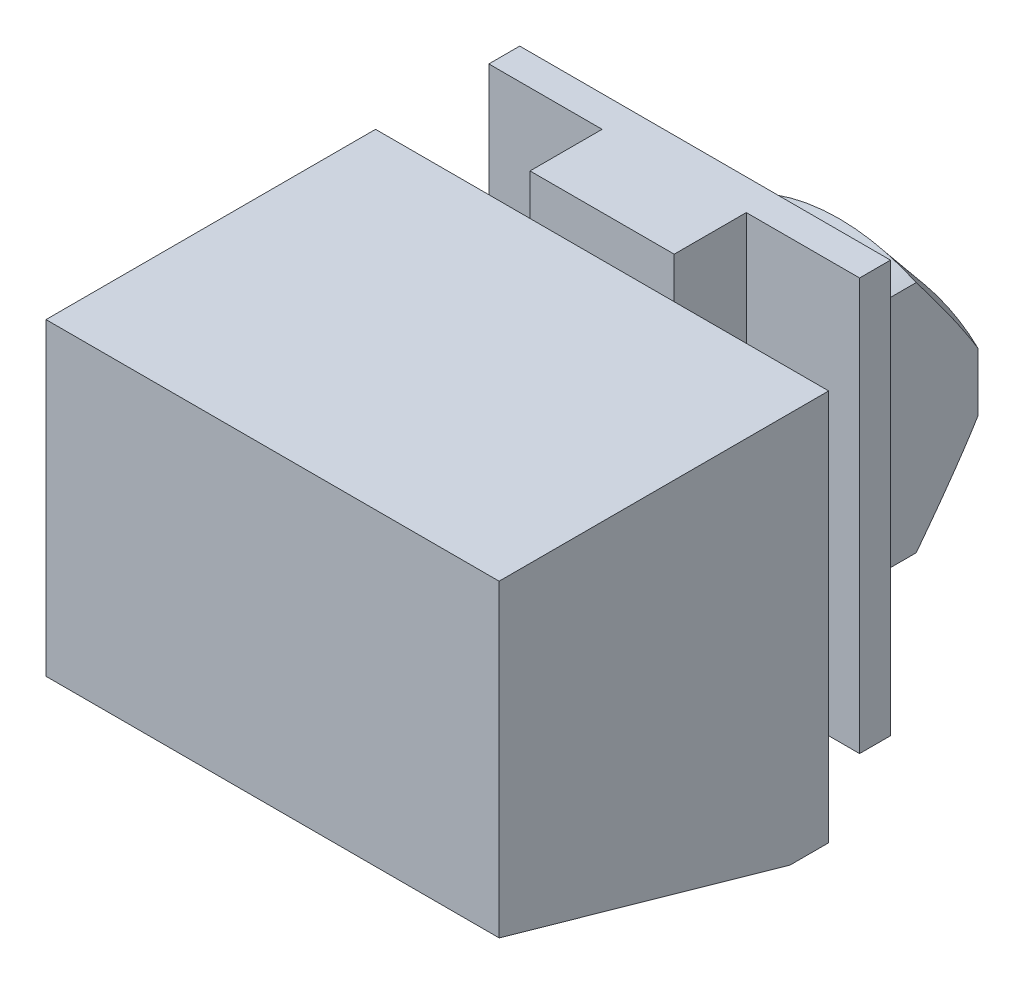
ISO-10303-21;
HEADER;
FILE_DESCRIPTION(('STEP AP214'),'2;1');
FILE_NAME('part.step','',(''),(''),'','','');
FILE_SCHEMA(('AUTOMOTIVE_DESIGN { 1 0 10303 214 1 1 1 1 }'));
ENDSEC;
DATA;
#1=APPLICATION_CONTEXT('core data for automotive mechanical design processes');
#2=APPLICATION_PROTOCOL_DEFINITION('international standard','automotive_design',2000,#1);
#3=PRODUCT_CONTEXT('',#1,'mechanical');
#4=PRODUCT('Part','Part','',(#3));
#5=PRODUCT_RELATED_PRODUCT_CATEGORY('part','',(#4));
#6=PRODUCT_DEFINITION_FORMATION('','',#4);
#7=PRODUCT_DEFINITION_CONTEXT('part definition',#1,'design');
#8=PRODUCT_DEFINITION('design','',#6,#7);
#9=PRODUCT_DEFINITION_SHAPE('','',#8);
#10=(LENGTH_UNIT() NAMED_UNIT(*) SI_UNIT(.MILLI.,.METRE.));
#11=(NAMED_UNIT(*) PLANE_ANGLE_UNIT() SI_UNIT($,.RADIAN.));
#12=(NAMED_UNIT(*) SI_UNIT($,.STERADIAN.) SOLID_ANGLE_UNIT());
#13=UNCERTAINTY_MEASURE_WITH_UNIT(LENGTH_MEASURE(1.E-05),#10,'distance_accuracy_value','');
#14=(GEOMETRIC_REPRESENTATION_CONTEXT(3) GLOBAL_UNCERTAINTY_ASSIGNED_CONTEXT((#13)) GLOBAL_UNIT_ASSIGNED_CONTEXT((#10,
#11,#12)) REPRESENTATION_CONTEXT('',''));
#15=CARTESIAN_POINT('',(0.,0.,0.));
#16=DIRECTION('',(0.,0.,1.));
#17=DIRECTION('',(1.,0.,0.));
#18=AXIS2_PLACEMENT_3D('',#15,#16,#17);
#19=CARTESIAN_POINT('',(-3.75000000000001,-2.98323400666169,-9.5));
#20=DIRECTION('',(0.,0.,-1.));
#21=DIRECTION('',(0.,1.,0.));
#22=AXIS2_PLACEMENT_3D('',#19,#20,#21);
#23=PLANE('',#22);
#24=DIRECTION('',(0.,1.,0.));
#25=VECTOR('',#24,1.);
#26=CARTESIAN_POINT('',(3.75,0.,-9.50000000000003));
#27=LINE('',#26,#25);
#28=CARTESIAN_POINT('',(3.75,1.41985913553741,-9.50000000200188));
#29=VERTEX_POINT('',#28);
#30=CARTESIAN_POINT('',(3.75,-1.41985913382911,-9.50000000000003));
#31=VERTEX_POINT('',#30);
#32=EDGE_CURVE('E191',#29,#31,#27,.F.);
#33=ORIENTED_EDGE('',*,*,#32,.T.);
#34=CARTESIAN_POINT('',(0.,2.5,-9.50000000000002));
#35=DIRECTION('',(0.,0.,1.));
#36=DIRECTION('',(0.,-1.,0.));
#37=AXIS2_PLACEMENT_3D('',#34,#35,#36);
#38=CIRCLE('',#37,5.42473922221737);
#39=CARTESIAN_POINT('',(-3.75,-1.41985913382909,-9.50000000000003));
#40=VERTEX_POINT('',#39);
#41=EDGE_CURVE('E19',#40,#31,#38,.T.);
#42=ORIENTED_EDGE('',*,*,#41,.F.);
#43=DIRECTION('',(0.,1.,0.));
#44=VECTOR('',#43,1.);
#45=CARTESIAN_POINT('',(-3.75,0.,-9.50000000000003));
#46=LINE('',#45,#44);
#47=CARTESIAN_POINT('',(-3.75,1.41985913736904,-9.50000000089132));
#48=VERTEX_POINT('',#47);
#49=EDGE_CURVE('E188',#40,#48,#46,.T.);
#50=ORIENTED_EDGE('',*,*,#49,.T.);
#51=CARTESIAN_POINT('',(0.,-2.5,-9.50000000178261));
#52=DIRECTION('',(0.,0.,1.));
#53=DIRECTION('',(1.,0.,0.));
#54=AXIS2_PLACEMENT_3D('',#51,#52,#53);
#55=CIRCLE('',#54,5.42473922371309);
#56=EDGE_CURVE('E195',#29,#48,#55,.T.);
#57=ORIENTED_EDGE('',*,*,#56,.F.);
#58=EDGE_LOOP('',(#33,#42,#50,#57));
#59=FACE_BOUND('',#58,.T.);
#60=ADVANCED_FACE('F15',(#59),#23,.T.);
#61=CARTESIAN_POINT('',(0.,2.5,-6.5));
#62=DIRECTION('',(0.,0.,1.));
#63=DIRECTION('',(0.,-1.,0.));
#64=AXIS2_PLACEMENT_3D('',#61,#62,#63);
#65=CONICAL_SURFACE('',#64,9.00000000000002,0.872664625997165);
#66=CARTESIAN_POINT('',(3.75,-1.41985913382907,-9.50000000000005));
#67=CARTESIAN_POINT('',(3.75,-1.51281005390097,-9.44363609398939));
#68=CARTESIAN_POINT('',(3.75,-1.60533852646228,-9.38658194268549));
#69=CARTESIAN_POINT('',(3.75,-1.78963228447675,-9.27126241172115));
#70=CARTESIAN_POINT('',(3.75,-1.88139760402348,-9.21299708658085));
#71=CARTESIAN_POINT('',(3.75,-2.15564833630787,-9.03665335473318));
#72=CARTESIAN_POINT('',(3.75,-2.33712455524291,-8.91700517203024));
#73=CARTESIAN_POINT('',(3.75,-2.69780458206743,-8.67458087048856));
#74=CARTESIAN_POINT('',(3.75,-2.87700971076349,-8.55180670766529));
#75=CARTESIAN_POINT('',(3.75,-3.23368469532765,-8.30374639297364));
#76=CARTESIAN_POINT('',(3.75,-3.41115445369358,-8.1784601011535));
#77=CARTESIAN_POINT('',(3.75,-3.76458421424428,-7.92595586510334));
#78=CARTESIAN_POINT('',(3.75,-3.94054489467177,-7.79873886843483));
#79=CARTESIAN_POINT('',(3.75,-4.29129243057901,-7.54269613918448));
#80=CARTESIAN_POINT('',(3.75,-4.46607927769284,-7.41387039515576));
#81=CARTESIAN_POINT('',(3.75,-4.81478223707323,-7.15482700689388));
#82=CARTESIAN_POINT('',(3.75,-4.9886977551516,-7.02460856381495));
#83=CARTESIAN_POINT('',(3.75,-5.33569980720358,-6.76307385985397));
#84=CARTESIAN_POINT('',(3.75,-5.50878634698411,-6.63175760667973));
#85=CARTESIAN_POINT('',(3.75,-5.6815340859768,-6.50000000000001));
#86=B_SPLINE_CURVE_WITH_KNOTS('',3,(#66,#67,#68,#69,#70,#71,#72,#73,#74,#75,#76,#77,#78,#79,#80,
#81,#82,#83,#84,#85),.UNSPECIFIED.,.F.,.F.,(4,2,2,2,2,2,2,2,2,4),(0.,0.326106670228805,
0.652198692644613,1.30425608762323,1.95591503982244,2.60761039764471,3.25899564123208,
3.91038552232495,4.56217155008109,5.21395300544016),.UNSPECIFIED.);
#87=CARTESIAN_POINT('',(3.75,-5.68153408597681,-6.50000000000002));
#88=VERTEX_POINT('',#87);
#89=EDGE_CURVE('E246',#31,#88,#86,.T.);
#90=ORIENTED_EDGE('',*,*,#89,.T.);
#91=CARTESIAN_POINT('',(0.,2.5,-6.50000000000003));
#92=DIRECTION('',(0.,0.,1.));
#93=DIRECTION('',(1.,0.,0.));
#94=AXIS2_PLACEMENT_3D('',#91,#92,#93);
#95=CIRCLE('',#94,9.00000000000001);
#96=CARTESIAN_POINT('',(-3.75,-5.68153408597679,-6.50000000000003));
#97=VERTEX_POINT('',#96);
#98=EDGE_CURVE('E199',#97,#88,#95,.T.);
#99=ORIENTED_EDGE('',*,*,#98,.F.);
#100=CARTESIAN_POINT('',(-3.75,-5.68153408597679,-6.50000000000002));
#101=CARTESIAN_POINT('',(-3.75,-5.50878634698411,-6.63175760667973));
#102=CARTESIAN_POINT('',(-3.75,-5.33569980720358,-6.76307385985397));
#103=CARTESIAN_POINT('',(-3.75,-4.98869775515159,-7.02460856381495));
#104=CARTESIAN_POINT('',(-3.75,-4.81478223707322,-7.15482700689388));
#105=CARTESIAN_POINT('',(-3.75,-4.46607927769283,-7.41387039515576));
#106=CARTESIAN_POINT('',(-3.75,-4.291292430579,-7.54269613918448));
#107=CARTESIAN_POINT('',(-3.75,-3.94054489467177,-7.79873886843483));
#108=CARTESIAN_POINT('',(-3.75,-3.76458421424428,-7.92595586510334));
#109=CARTESIAN_POINT('',(-3.75,-3.41115445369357,-8.1784601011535));
#110=CARTESIAN_POINT('',(-3.75,-3.23368469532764,-8.30374639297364));
#111=CARTESIAN_POINT('',(-3.75,-2.87700971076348,-8.55180670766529));
#112=CARTESIAN_POINT('',(-3.75,-2.69780458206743,-8.67458087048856));
#113=CARTESIAN_POINT('',(-3.75,-2.3371245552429,-8.91700517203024));
#114=CARTESIAN_POINT('',(-3.75,-2.15564833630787,-9.03665335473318));
#115=CARTESIAN_POINT('',(-3.75,-1.88139760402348,-9.21299708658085));
#116=CARTESIAN_POINT('',(-3.75,-1.78963228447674,-9.27126241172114));
#117=CARTESIAN_POINT('',(-3.75,-1.60533852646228,-9.38658194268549));
#118=CARTESIAN_POINT('',(-3.75,-1.51281005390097,-9.44363609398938));
#119=CARTESIAN_POINT('',(-3.75,-1.41985913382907,-9.50000000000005));
#120=B_SPLINE_CURVE_WITH_KNOTS('',3,(#100,#101,#102,#103,#104,#105,#106,#107,#108,#109,#110,
#111,#112,#113,#114,#115,#116,#117,#118,#119),.UNSPECIFIED.,.F.,.F.,(4,2,2,2,2,2,2,2,2,4),(0.,
0.651781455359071,1.3035674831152,1.95495736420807,2.60634260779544,3.25803796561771,
3.90969691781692,4.56175431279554,4.88784633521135,5.21395300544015),.UNSPECIFIED.);
#121=EDGE_CURVE('E197',#97,#40,#120,.T.);
#122=ORIENTED_EDGE('',*,*,#121,.T.);
#123=ORIENTED_EDGE('',*,*,#41,.T.);
#124=EDGE_LOOP('',(#90,#99,#122,#123));
#125=FACE_BOUND('',#124,.T.);
#126=ADVANCED_FACE('F198',(#125),#65,.T.);
#127=CARTESIAN_POINT('',(0.,-2.5,-6.49999999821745));
#128=DIRECTION('',(0.,0.,1.));
#129=DIRECTION('',(1.,0.,0.));
#130=AXIS2_PLACEMENT_3D('',#127,#128,#129);
#131=CONICAL_SURFACE('',#130,8.99999999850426,0.872664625);
#132=CARTESIAN_POINT('',(3.75000000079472,5.68153408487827,-6.49999999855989));
#133=CARTESIAN_POINT('',(3.75000000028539,5.50878634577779,-6.63175760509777));
#134=CARTESIAN_POINT('',(3.75000000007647,5.3356998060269,-6.76307385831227));
#135=CARTESIAN_POINT('',(3.74999999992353,4.9886977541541,-7.02460856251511));
#136=CARTESIAN_POINT('',(3.74999999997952,4.81478223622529,-7.15482700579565));
#137=CARTESIAN_POINT('',(3.75000000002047,4.46607927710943,-7.41387039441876));
#138=CARTESIAN_POINT('',(3.75000000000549,4.29129243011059,-7.54269613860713));
#139=CARTESIAN_POINT('',(3.74999999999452,3.94054489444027,-7.79873886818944));
#140=CARTESIAN_POINT('',(3.74999999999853,3.76458421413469,-7.92595586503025));
#141=CARTESIAN_POINT('',(3.75000000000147,3.41115445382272,-8.17846010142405));
#142=CARTESIAN_POINT('',(3.7500000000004,3.2336846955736,-8.30374639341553));
#143=CARTESIAN_POINT('',(3.74999999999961,2.87700971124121,-8.55180670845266));
#144=CARTESIAN_POINT('',(3.7499999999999,2.69780458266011,-8.67458087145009));
#145=CARTESIAN_POINT('',(3.75000000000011,2.33712455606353,-8.91700517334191));
#146=CARTESIAN_POINT('',(3.75000000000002,2.15564833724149,-9.03665335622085));
#147=CARTESIAN_POINT('',(3.74999999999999,1.88139760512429,-9.21299708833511));
#148=CARTESIAN_POINT('',(3.75,1.78963228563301,-9.27126241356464));
#149=CARTESIAN_POINT('',(3.75000000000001,1.60533852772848,-9.38658194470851));
#150=CARTESIAN_POINT('',(3.75000000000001,1.51281005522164,-9.4436360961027));
#151=CARTESIAN_POINT('',(3.75,1.41985913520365,-9.50000000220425));
#152=B_SPLINE_CURVE_WITH_KNOTS('',3,(#132,#133,#134,#135,#136,#137,#138,#139,#140,#141,#142,
#143,#144,#145,#146,#147,#148,#149,#150,#151),.UNSPECIFIED.,.F.,.F.,(4,2,2,2,2,2,2,2,2,4),(0.,
0.651781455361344,1.3035674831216,1.95495736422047,2.60634260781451,3.25803796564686,
3.90969691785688,4.56175431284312,4.88784633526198,5.21395300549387),.UNSPECIFIED.);
#153=CARTESIAN_POINT('',(3.75,5.68153408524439,-6.49999999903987));
#154=VERTEX_POINT('',#153);
#155=EDGE_CURVE('E254',#154,#29,#152,.T.);
#156=ORIENTED_EDGE('',*,*,#155,.T.);
#157=ORIENTED_EDGE('',*,*,#56,.T.);
#158=CARTESIAN_POINT('',(-3.7499999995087,1.41985913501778,-9.50000000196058));
#159=CARTESIAN_POINT('',(-3.74999999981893,1.51281005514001,-9.44363609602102));
#160=CARTESIAN_POINT('',(-3.74999999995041,1.60533852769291,-9.38658194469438));
#161=CARTESIAN_POINT('',(-3.75000000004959,1.78963228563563,-9.27126241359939));
#162=CARTESIAN_POINT('',(-3.7500000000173,1.88139760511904,-9.2129970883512));
#163=CARTESIAN_POINT('',(-3.7499999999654,2.15564833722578,-9.03665335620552));
#164=CARTESIAN_POINT('',(-3.74999999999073,2.33712455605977,-8.91700517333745));
#165=CARTESIAN_POINT('',(-3.75000000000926,2.69780458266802,-8.67458087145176));
#166=CARTESIAN_POINT('',(-3.75000000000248,2.87700971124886,-8.55180670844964));
#167=CARTESIAN_POINT('',(-3.74999999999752,3.23368469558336,-8.30374639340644));
#168=CARTESIAN_POINT('',(-3.74999999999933,3.41115445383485,-8.1784601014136));
#169=CARTESIAN_POINT('',(-3.75000000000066,3.76458421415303,-7.92595586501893));
#170=CARTESIAN_POINT('',(-3.75000000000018,3.94054489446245,-7.79873886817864));
#171=CARTESIAN_POINT('',(-3.74999999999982,4.29129243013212,-7.54269613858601));
#172=CARTESIAN_POINT('',(-3.74999999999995,4.46607927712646,-7.41387039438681));
#173=CARTESIAN_POINT('',(-3.75000000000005,4.81478223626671,-7.1548270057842));
#174=CARTESIAN_POINT('',(-3.75000000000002,4.98869775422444,-7.02460856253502));
#175=CARTESIAN_POINT('',(-3.74999999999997,5.33569980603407,-6.76307385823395));
#176=CARTESIAN_POINT('',(-3.74999999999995,5.50878634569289,-6.63175760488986));
#177=CARTESIAN_POINT('',(-3.75,5.68153408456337,-6.49999999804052));
#178=B_SPLINE_CURVE_WITH_KNOTS('',3,(#158,#159,#160,#161,#162,#163,#164,#165,#166,#167,#168,
#169,#170,#171,#172,#173,#174,#175,#176,#177),.UNSPECIFIED.,.F.,.F.,(4,2,2,2,2,2,2,2,2,4),(0.,
0.326106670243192,0.652198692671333,1.30425608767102,1.95591503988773,2.60761039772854,
3.25899564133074,3.91038552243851,4.56217155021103,5.21395300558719),.UNSPECIFIED.);
#179=CARTESIAN_POINT('',(-3.74999999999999,5.68153408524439,-6.49999999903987));
#180=VERTEX_POINT('',#179);
#181=EDGE_CURVE('E206',#48,#180,#178,.T.);
#182=ORIENTED_EDGE('',*,*,#181,.T.);
#183=CARTESIAN_POINT('',(0.,-2.5,-6.50000000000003));
#184=DIRECTION('',(0.,0.,-1.));
#185=DIRECTION('',(-1.,0.,0.));
#186=AXIS2_PLACEMENT_3D('',#183,#184,#185);
#187=CIRCLE('',#186,9.);
#188=EDGE_CURVE('E213',#154,#180,#187,.F.);
#189=ORIENTED_EDGE('',*,*,#188,.F.);
#190=EDGE_LOOP('',(#156,#157,#182,#189));
#191=FACE_BOUND('',#190,.T.);
#192=ADVANCED_FACE('F267',(#191),#131,.T.);
#193=CARTESIAN_POINT('',(-3.75,0.,-7.00000000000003));
#194=DIRECTION('',(1.,0.,0.));
#195=DIRECTION('',(0.,0.,-1.));
#196=AXIS2_PLACEMENT_3D('',#193,#194,#195);
#197=PLANE('',#196);
#198=ORIENTED_EDGE('',*,*,#49,.F.);
#199=ORIENTED_EDGE('',*,*,#121,.F.);
#200=DIRECTION('',(0.,0.,-1.));
#201=VECTOR('',#200,1.);
#202=CARTESIAN_POINT('',(-3.74999999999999,-5.68153408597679,-5.50000000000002));
#203=LINE('',#202,#201);
#204=CARTESIAN_POINT('',(-3.75,-5.68153408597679,-4.5));
#205=VERTEX_POINT('',#204);
#206=EDGE_CURVE('E208',#205,#97,#203,.T.);
#207=ORIENTED_EDGE('',*,*,#206,.F.);
#208=DIRECTION('',(0.,-1.,0.));
#209=VECTOR('',#208,1.);
#210=CARTESIAN_POINT('',(-3.75,0.,-4.5));
#211=LINE('',#210,#209);
#212=CARTESIAN_POINT('',(-3.75,5.68153408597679,-4.50000000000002));
#213=VERTEX_POINT('',#212);
#214=EDGE_CURVE('E216',#213,#205,#211,.T.);
#215=ORIENTED_EDGE('',*,*,#214,.F.);
#216=DIRECTION('',(0.,0.,-1.));
#217=VECTOR('',#216,1.);
#218=CARTESIAN_POINT('',(-3.74999999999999,5.68153408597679,-5.5));
#219=LINE('',#218,#217);
#220=EDGE_CURVE('E253',#180,#213,#219,.F.);
#221=ORIENTED_EDGE('',*,*,#220,.F.);
#222=ORIENTED_EDGE('',*,*,#181,.F.);
#223=EDGE_LOOP('',(#198,#199,#207,#215,#221,#222));
#224=FACE_BOUND('',#223,.T.);
#225=ADVANCED_FACE('F204',(#224),#197,.F.);
#226=CARTESIAN_POINT('',(0.,2.5,-4.5));
#227=DIRECTION('',(0.,0.,-1.));
#228=DIRECTION('',(0.,1.,0.));
#229=AXIS2_PLACEMENT_3D('',#226,#227,#228);
#230=CYLINDRICAL_SURFACE('',#229,9.00000000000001);
#231=DIRECTION('',(0.,0.,1.));
#232=VECTOR('',#231,1.);
#233=CARTESIAN_POINT('',(3.75,-5.68153408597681,-7.00000000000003));
#234=LINE('',#233,#232);
#235=CARTESIAN_POINT('',(3.75,-5.6815340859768,-4.5));
#236=VERTEX_POINT('',#235);
#237=EDGE_CURVE('E219',#88,#236,#234,.T.);
#238=ORIENTED_EDGE('',*,*,#237,.T.);
#239=CARTESIAN_POINT('',(0.,2.5,-4.5));
#240=DIRECTION('',(0.,0.,-1.));
#241=DIRECTION('',(0.,1.,0.));
#242=AXIS2_PLACEMENT_3D('',#239,#240,#241);
#243=CIRCLE('',#242,9.00000000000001);
#244=EDGE_CURVE('E243',#205,#236,#243,.F.);
#245=ORIENTED_EDGE('',*,*,#244,.F.);
#246=ORIENTED_EDGE('',*,*,#206,.T.);
#247=ORIENTED_EDGE('',*,*,#98,.T.);
#248=EDGE_LOOP('',(#238,#245,#246,#247));
#249=FACE_BOUND('',#248,.T.);
#250=ADVANCED_FACE('F268',(#249),#230,.T.);
#251=CARTESIAN_POINT('',(3.75,0.,-7.00000000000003));
#252=DIRECTION('',(-1.,0.,0.));
#253=DIRECTION('',(0.,0.,1.));
#254=AXIS2_PLACEMENT_3D('',#251,#252,#253);
#255=PLANE('',#254);
#256=ORIENTED_EDGE('',*,*,#32,.F.);
#257=ORIENTED_EDGE('',*,*,#155,.F.);
#258=DIRECTION('',(0.,0.,-1.));
#259=VECTOR('',#258,1.);
#260=CARTESIAN_POINT('',(3.75,5.68153408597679,-5.5));
#261=LINE('',#260,#259);
#262=CARTESIAN_POINT('',(3.75,5.68153408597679,-4.50000000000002));
#263=VERTEX_POINT('',#262);
#264=EDGE_CURVE('E217',#263,#154,#261,.T.);
#265=ORIENTED_EDGE('',*,*,#264,.F.);
#266=DIRECTION('',(0.,1.,0.));
#267=VECTOR('',#266,1.);
#268=CARTESIAN_POINT('',(3.75,0.,-4.5));
#269=LINE('',#268,#267);
#270=EDGE_CURVE('E242',#236,#263,#269,.T.);
#271=ORIENTED_EDGE('',*,*,#270,.F.);
#272=ORIENTED_EDGE('',*,*,#237,.F.);
#273=ORIENTED_EDGE('',*,*,#89,.F.);
#274=EDGE_LOOP('',(#256,#257,#265,#271,#272,#273));
#275=FACE_BOUND('',#274,.T.);
#276=ADVANCED_FACE('F259',(#275),#255,.F.);
#277=CARTESIAN_POINT('',(0.,-2.5,-5.5));
#278=DIRECTION('',(0.,0.,-1.));
#279=DIRECTION('',(-1.,0.,0.));
#280=AXIS2_PLACEMENT_3D('',#277,#278,#279);
#281=CYLINDRICAL_SURFACE('',#280,9.);
#282=ORIENTED_EDGE('',*,*,#264,.T.);
#283=ORIENTED_EDGE('',*,*,#188,.T.);
#284=ORIENTED_EDGE('',*,*,#220,.T.);
#285=CARTESIAN_POINT('',(0.,-2.5,-4.50000000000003));
#286=DIRECTION('',(0.,0.,-1.));
#287=DIRECTION('',(-1.,0.,0.));
#288=AXIS2_PLACEMENT_3D('',#285,#286,#287);
#289=CIRCLE('',#288,9.);
#290=EDGE_CURVE('E238',#263,#213,#289,.F.);
#291=ORIENTED_EDGE('',*,*,#290,.F.);
#292=EDGE_LOOP('',(#282,#283,#284,#291));
#293=FACE_BOUND('',#292,.T.);
#294=ADVANCED_FACE('F377',(#293),#281,.T.);
#295=CARTESIAN_POINT('',(-3.75,6.63,-4.5));
#296=DIRECTION('',(0.,0.,1.));
#297=DIRECTION('',(0.,-1.,0.));
#298=AXIS2_PLACEMENT_3D('',#295,#296,#297);
#299=PLANE('',#298);
#300=DIRECTION('',(1.,0.,0.));
#301=VECTOR('',#300,1.);
#302=CARTESIAN_POINT('',(3.25,-4.,-4.5));
#303=LINE('',#302,#301);
#304=CARTESIAN_POINT('',(-0.249999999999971,-4.,-4.5));
#305=VERTEX_POINT('',#304);
#306=CARTESIAN_POINT('',(3.25000000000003,-4.,-4.5));
#307=VERTEX_POINT('',#306);
#308=EDGE_CURVE('E408',#305,#307,#303,.T.);
#309=ORIENTED_EDGE('',*,*,#308,.F.);
#310=CARTESIAN_POINT('',(-0.249999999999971,-1.,-4.5));
#311=DIRECTION('',(0.,0.,1.));
#312=DIRECTION('',(1.,0.,0.));
#313=AXIS2_PLACEMENT_3D('',#310,#311,#312);
#314=CIRCLE('',#313,3.);
#315=CARTESIAN_POINT('',(-3.24999999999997,-1.,-4.5));
#316=VERTEX_POINT('',#315);
#317=EDGE_CURVE('E234',#316,#305,#314,.T.);
#318=ORIENTED_EDGE('',*,*,#317,.F.);
#319=DIRECTION('',(0.,1.,0.));
#320=VECTOR('',#319,1.);
#321=CARTESIAN_POINT('',(-3.24999999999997,-1.,-4.5));
#322=LINE('',#321,#320);
#323=CARTESIAN_POINT('',(-3.24999999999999,4.,-4.5));
#324=VERTEX_POINT('',#323);
#325=EDGE_CURVE('E420',#324,#316,#322,.F.);
#326=ORIENTED_EDGE('',*,*,#325,.F.);
#327=DIRECTION('',(1.,0.,0.));
#328=VECTOR('',#327,1.);
#329=CARTESIAN_POINT('',(-3.25,4.,-4.5));
#330=LINE('',#329,#328);
#331=CARTESIAN_POINT('',(0.250000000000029,4.,-4.5));
#332=VERTEX_POINT('',#331);
#333=EDGE_CURVE('E424',#332,#324,#330,.F.);
#334=ORIENTED_EDGE('',*,*,#333,.F.);
#335=CARTESIAN_POINT('',(0.25000000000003,0.999999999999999,-4.5));
#336=DIRECTION('',(0.,0.,1.));
#337=DIRECTION('',(1.,0.,0.));
#338=AXIS2_PLACEMENT_3D('',#335,#336,#337);
#339=CIRCLE('',#338,3.);
#340=CARTESIAN_POINT('',(3.25000000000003,0.999999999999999,-4.5));
#341=VERTEX_POINT('',#340);
#342=EDGE_CURVE('E230',#341,#332,#339,.T.);
#343=ORIENTED_EDGE('',*,*,#342,.F.);
#344=DIRECTION('',(0.,1.,0.));
#345=VECTOR('',#344,1.);
#346=CARTESIAN_POINT('',(3.25000000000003,0.999999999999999,-4.5));
#347=LINE('',#346,#345);
#348=EDGE_CURVE('E406',#307,#341,#347,.T.);
#349=ORIENTED_EDGE('',*,*,#348,.F.);
#350=EDGE_LOOP('',(#309,#318,#326,#334,#343,#349));
#351=FACE_BOUND('',#350,.T.);
#352=ORIENTED_EDGE('',*,*,#270,.T.);
#353=ORIENTED_EDGE('',*,*,#290,.T.);
#354=ORIENTED_EDGE('',*,*,#214,.T.);
#355=ORIENTED_EDGE('',*,*,#244,.T.);
#356=EDGE_LOOP('',(#352,#353,#354,#355));
#357=FACE_BOUND('',#356,.T.);
#358=ADVANCED_FACE('F379',(#351,#357),#299,.T.);
#359=CARTESIAN_POINT('',(-9.00000000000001,12.5,1.5));
#360=DIRECTION('',(-1.,0.,0.));
#361=DIRECTION('',(0.,0.,-1.));
#362=AXIS2_PLACEMENT_3D('',#359,#360,#361);
#363=PLANE('',#362);
#364=DIRECTION('',(0.,1.,0.));
#365=VECTOR('',#364,1.);
#366=CARTESIAN_POINT('',(-9.00000000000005,-7.5,0.));
#367=LINE('',#366,#365);
#368=CARTESIAN_POINT('',(-9.00000000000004,-7.5,0.));
#369=VERTEX_POINT('',#368);
#370=CARTESIAN_POINT('',(-9.00000000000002,12.5,0.));
#371=VERTEX_POINT('',#370);
#372=EDGE_CURVE('E458',#369,#371,#367,.T.);
#373=ORIENTED_EDGE('',*,*,#372,.F.);
#374=DIRECTION('',(0.,0.,1.));
#375=VECTOR('',#374,1.);
#376=CARTESIAN_POINT('',(-9.00000000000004,-7.5,0.749999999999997));
#377=LINE('',#376,#375);
#378=CARTESIAN_POINT('',(-9.00000000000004,-7.5,1.5));
#379=VERTEX_POINT('',#378);
#380=EDGE_CURVE('E421',#369,#379,#377,.T.);
#381=ORIENTED_EDGE('',*,*,#380,.T.);
#382=DIRECTION('',(0.,1.,0.));
#383=VECTOR('',#382,1.);
#384=CARTESIAN_POINT('',(-9.00000000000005,-1.20710678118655,1.5));
#385=LINE('',#384,#383);
#386=CARTESIAN_POINT('',(-9.00000000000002,12.5,1.5));
#387=VERTEX_POINT('',#386);
#388=EDGE_CURVE('E461',#379,#387,#385,.T.);
#389=ORIENTED_EDGE('',*,*,#388,.T.);
#390=DIRECTION('',(0.,0.,-1.));
#391=VECTOR('',#390,1.);
#392=CARTESIAN_POINT('',(-9.00000000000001,12.5,0.749999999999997));
#393=LINE('',#392,#391);
#394=EDGE_CURVE('E241',#387,#371,#393,.T.);
#395=ORIENTED_EDGE('',*,*,#394,.T.);
#396=EDGE_LOOP('',(#373,#381,#389,#395));
#397=FACE_BOUND('',#396,.T.);
#398=ADVANCED_FACE('F17',(#397),#363,.T.);
#399=CARTESIAN_POINT('',(-3.24999999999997,-1.,-4.5));
#400=DIRECTION('',(-1.,0.,0.));
#401=DIRECTION('',(0.,0.,1.));
#402=AXIS2_PLACEMENT_3D('',#399,#400,#401);
#403=PLANE('',#402);
#404=DIRECTION('',(0.,1.,0.));
#405=VECTOR('',#404,1.);
#406=CARTESIAN_POINT('',(-3.25,-7.5,0.));
#407=LINE('',#406,#405);
#408=CARTESIAN_POINT('',(-3.25,4.,0.));
#409=VERTEX_POINT('',#408);
#410=CARTESIAN_POINT('',(-3.24999999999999,-1.,0.));
#411=VERTEX_POINT('',#410);
#412=EDGE_CURVE('E229',#409,#411,#407,.F.);
#413=ORIENTED_EDGE('',*,*,#412,.F.);
#414=DIRECTION('',(0.,0.,1.));
#415=VECTOR('',#414,1.);
#416=CARTESIAN_POINT('',(-3.25,4.,-4.5));
#417=LINE('',#416,#415);
#418=EDGE_CURVE('E426',#324,#409,#417,.T.);
#419=ORIENTED_EDGE('',*,*,#418,.F.);
#420=ORIENTED_EDGE('',*,*,#325,.T.);
#421=DIRECTION('',(0.,0.,1.));
#422=VECTOR('',#421,1.);
#423=CARTESIAN_POINT('',(-3.24999999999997,-0.999999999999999,-4.5));
#424=LINE('',#423,#422);
#425=EDGE_CURVE('E237',#411,#316,#424,.F.);
#426=ORIENTED_EDGE('',*,*,#425,.F.);
#427=EDGE_LOOP('',(#413,#419,#420,#426));
#428=FACE_BOUND('',#427,.T.);
#429=ADVANCED_FACE('F373',(#428),#403,.T.);
#430=CARTESIAN_POINT('',(-0.249999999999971,-1.,-4.5));
#431=DIRECTION('',(0.,0.,1.));
#432=DIRECTION('',(1.,0.,0.));
#433=AXIS2_PLACEMENT_3D('',#430,#431,#432);
#434=CYLINDRICAL_SURFACE('',#433,3.);
#435=ORIENTED_EDGE('',*,*,#317,.T.);
#436=DIRECTION('',(0.,0.,-1.));
#437=VECTOR('',#436,1.);
#438=CARTESIAN_POINT('',(-0.249999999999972,-4.,-4.5));
#439=LINE('',#438,#437);
#440=CARTESIAN_POINT('',(-0.249999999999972,-4.,0.));
#441=VERTEX_POINT('',#440);
#442=EDGE_CURVE('E236',#441,#305,#439,.T.);
#443=ORIENTED_EDGE('',*,*,#442,.F.);
#444=CARTESIAN_POINT('',(-0.249999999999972,-1.,0.));
#445=DIRECTION('',(0.,0.,1.));
#446=DIRECTION('',(1.,0.,0.));
#447=AXIS2_PLACEMENT_3D('',#444,#445,#446);
#448=CIRCLE('',#447,3.);
#449=EDGE_CURVE('E225',#411,#441,#448,.T.);
#450=ORIENTED_EDGE('',*,*,#449,.F.);
#451=ORIENTED_EDGE('',*,*,#425,.T.);
#452=EDGE_LOOP('',(#435,#443,#450,#451));
#453=FACE_BOUND('',#452,.T.);
#454=ADVANCED_FACE('F369',(#453),#434,.T.);
#455=CARTESIAN_POINT('',(3.25,-4.,-4.5));
#456=DIRECTION('',(0.,-1.,0.));
#457=DIRECTION('',(0.,0.,-1.));
#458=AXIS2_PLACEMENT_3D('',#455,#456,#457);
#459=PLANE('',#458);
#460=ORIENTED_EDGE('',*,*,#308,.T.);
#461=DIRECTION('',(0.,0.,-1.));
#462=VECTOR('',#461,1.);
#463=CARTESIAN_POINT('',(3.25000000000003,-4.,-4.5));
#464=LINE('',#463,#462);
#465=CARTESIAN_POINT('',(3.25000000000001,-4.,0.));
#466=VERTEX_POINT('',#465);
#467=EDGE_CURVE('E407',#466,#307,#464,.T.);
#468=ORIENTED_EDGE('',*,*,#467,.F.);
#469=DIRECTION('',(-1.,0.,0.));
#470=VECTOR('',#469,1.);
#471=CARTESIAN_POINT('',(-3.5,-4.,0.));
#472=LINE('',#471,#470);
#473=EDGE_CURVE('E228',#441,#466,#472,.F.);
#474=ORIENTED_EDGE('',*,*,#473,.F.);
#475=ORIENTED_EDGE('',*,*,#442,.T.);
#476=EDGE_LOOP('',(#460,#468,#474,#475));
#477=FACE_BOUND('',#476,.T.);
#478=ADVANCED_FACE('F365',(#477),#459,.T.);
#479=CARTESIAN_POINT('',(3.25000000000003,0.999999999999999,-4.5));
#480=DIRECTION('',(1.,0.,0.));
#481=DIRECTION('',(0.,0.,-1.));
#482=AXIS2_PLACEMENT_3D('',#479,#480,#481);
#483=PLANE('',#482);
#484=DIRECTION('',(0.,1.,0.));
#485=VECTOR('',#484,1.);
#486=CARTESIAN_POINT('',(3.25,-7.5,0.));
#487=LINE('',#486,#485);
#488=CARTESIAN_POINT('',(3.25000000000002,0.999999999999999,0.));
#489=VERTEX_POINT('',#488);
#490=EDGE_CURVE('E224',#466,#489,#487,.T.);
#491=ORIENTED_EDGE('',*,*,#490,.F.);
#492=ORIENTED_EDGE('',*,*,#467,.T.);
#493=ORIENTED_EDGE('',*,*,#348,.T.);
#494=DIRECTION('',(0.,0.,1.));
#495=VECTOR('',#494,1.);
#496=CARTESIAN_POINT('',(3.25000000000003,0.999999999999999,-4.5));
#497=LINE('',#496,#495);
#498=EDGE_CURVE('E233',#489,#341,#497,.F.);
#499=ORIENTED_EDGE('',*,*,#498,.F.);
#500=EDGE_LOOP('',(#491,#492,#493,#499));
#501=FACE_BOUND('',#500,.T.);
#502=ADVANCED_FACE('F361',(#501),#483,.T.);
#503=CARTESIAN_POINT('',(0.25000000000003,0.999999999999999,-4.5));
#504=DIRECTION('',(0.,0.,1.));
#505=DIRECTION('',(1.,0.,0.));
#506=AXIS2_PLACEMENT_3D('',#503,#504,#505);
#507=CYLINDRICAL_SURFACE('',#506,3.);
#508=ORIENTED_EDGE('',*,*,#342,.T.);
#509=DIRECTION('',(0.,0.,1.));
#510=VECTOR('',#509,1.);
#511=CARTESIAN_POINT('',(0.250000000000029,4.,-4.5));
#512=LINE('',#511,#510);
#513=CARTESIAN_POINT('',(0.250000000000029,4.,0.));
#514=VERTEX_POINT('',#513);
#515=EDGE_CURVE('E232',#514,#332,#512,.F.);
#516=ORIENTED_EDGE('',*,*,#515,.F.);
#517=CARTESIAN_POINT('',(0.250000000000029,0.999999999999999,0.));
#518=DIRECTION('',(0.,0.,1.));
#519=DIRECTION('',(1.,0.,0.));
#520=AXIS2_PLACEMENT_3D('',#517,#518,#519);
#521=CIRCLE('',#520,3.);
#522=EDGE_CURVE('E220',#489,#514,#521,.T.);
#523=ORIENTED_EDGE('',*,*,#522,.F.);
#524=ORIENTED_EDGE('',*,*,#498,.T.);
#525=EDGE_LOOP('',(#508,#516,#523,#524));
#526=FACE_BOUND('',#525,.T.);
#527=ADVANCED_FACE('F357',(#526),#507,.T.);
#528=CARTESIAN_POINT('',(-3.25,4.,-4.5));
#529=DIRECTION('',(0.,1.,0.));
#530=DIRECTION('',(0.,0.,1.));
#531=AXIS2_PLACEMENT_3D('',#528,#529,#530);
#532=PLANE('',#531);
#533=ORIENTED_EDGE('',*,*,#333,.T.);
#534=ORIENTED_EDGE('',*,*,#418,.T.);
#535=DIRECTION('',(-1.,0.,0.));
#536=VECTOR('',#535,1.);
#537=CARTESIAN_POINT('',(-3.5,4.,0.));
#538=LINE('',#537,#536);
#539=EDGE_CURVE('E223',#514,#409,#538,.T.);
#540=ORIENTED_EDGE('',*,*,#539,.F.);
#541=ORIENTED_EDGE('',*,*,#515,.T.);
#542=EDGE_LOOP('',(#533,#534,#540,#541));
#543=FACE_BOUND('',#542,.T.);
#544=ADVANCED_FACE('F353',(#543),#532,.T.);
#545=CARTESIAN_POINT('',(9.00000000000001,5.5,1.73333333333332));
#546=DIRECTION('',(1.,0.,0.));
#547=DIRECTION('',(0.,0.,-1.));
#548=AXIS2_PLACEMENT_3D('',#545,#546,#547);
#549=PLANE('',#548);
#550=DIRECTION('',(0.,1.,0.));
#551=VECTOR('',#550,1.);
#552=CARTESIAN_POINT('',(9.00000000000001,-7.5,0.));
#553=LINE('',#552,#551);
#554=CARTESIAN_POINT('',(9.00000000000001,12.5,0.));
#555=VERTEX_POINT('',#554);
#556=CARTESIAN_POINT('',(9.00000000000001,-7.5,0.));
#557=VERTEX_POINT('',#556);
#558=EDGE_CURVE('E455',#555,#557,#553,.F.);
#559=ORIENTED_EDGE('',*,*,#558,.F.);
#560=DIRECTION('',(0.,0.,-1.));
#561=VECTOR('',#560,1.);
#562=CARTESIAN_POINT('',(9.00000000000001,12.5,1.73333333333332));
#563=LINE('',#562,#561);
#564=CARTESIAN_POINT('',(9.00000000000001,12.5,1.5));
#565=VERTEX_POINT('',#564);
#566=EDGE_CURVE('E463',#555,#565,#563,.F.);
#567=ORIENTED_EDGE('',*,*,#566,.T.);
#568=DIRECTION('',(0.,1.,0.));
#569=VECTOR('',#568,1.);
#570=CARTESIAN_POINT('',(9.00000000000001,12.5,1.5));
#571=LINE('',#570,#569);
#572=CARTESIAN_POINT('',(9.00000000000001,-7.5,1.5));
#573=VERTEX_POINT('',#572);
#574=EDGE_CURVE('E449',#565,#573,#571,.F.);
#575=ORIENTED_EDGE('',*,*,#574,.T.);
#576=DIRECTION('',(0.,0.,-1.));
#577=VECTOR('',#576,1.);
#578=CARTESIAN_POINT('',(9.00000000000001,-7.50000000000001,1.73333333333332));
#579=LINE('',#578,#577);
#580=EDGE_CURVE('E430',#573,#557,#579,.T.);
#581=ORIENTED_EDGE('',*,*,#580,.T.);
#582=EDGE_LOOP('',(#559,#567,#575,#581));
#583=FACE_BOUND('',#582,.T.);
#584=ADVANCED_FACE('F349',(#583),#549,.T.);
#585=CARTESIAN_POINT('',(0.,-1.20710678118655,1.5));
#586=DIRECTION('',(0.,0.,-1.));
#587=DIRECTION('',(-1.,0.,0.));
#588=AXIS2_PLACEMENT_3D('',#585,#586,#587);
#589=PLANE('',#588);
#590=DIRECTION('',(0.,1.,0.));
#591=VECTOR('',#590,1.);
#592=CARTESIAN_POINT('',(-3.5,-7.5,1.5));
#593=LINE('',#592,#591);
#594=CARTESIAN_POINT('',(-3.50000000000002,12.5,1.5));
#595=VERTEX_POINT('',#594);
#596=CARTESIAN_POINT('',(-3.50000000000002,-7.5,1.5));
#597=VERTEX_POINT('',#596);
#598=EDGE_CURVE('E491',#595,#597,#593,.F.);
#599=ORIENTED_EDGE('',*,*,#598,.F.);
#600=DIRECTION('',(1.,0.,0.));
#601=VECTOR('',#600,1.);
#602=CARTESIAN_POINT('',(3.5,12.5,1.5));
#603=LINE('',#602,#601);
#604=EDGE_CURVE('E494',#387,#595,#603,.T.);
#605=ORIENTED_EDGE('',*,*,#604,.F.);
#606=ORIENTED_EDGE('',*,*,#388,.F.);
#607=DIRECTION('',(1.,0.,0.));
#608=VECTOR('',#607,1.);
#609=CARTESIAN_POINT('',(0.,-7.5,1.5));
#610=LINE('',#609,#608);
#611=EDGE_CURVE('E486',#379,#597,#610,.T.);
#612=ORIENTED_EDGE('',*,*,#611,.T.);
#613=EDGE_LOOP('',(#599,#605,#606,#612));
#614=FACE_BOUND('',#613,.T.);
#615=ADVANCED_FACE('F345',(#614),#589,.F.);
#616=CARTESIAN_POINT('',(-3.5,-7.5,0.));
#617=DIRECTION('',(0.,0.,-1.));
#618=DIRECTION('',(-1.,0.,0.));
#619=AXIS2_PLACEMENT_3D('',#616,#617,#618);
#620=PLANE('',#619);
#621=ORIENTED_EDGE('',*,*,#522,.T.);
#622=ORIENTED_EDGE('',*,*,#539,.T.);
#623=ORIENTED_EDGE('',*,*,#412,.T.);
#624=ORIENTED_EDGE('',*,*,#449,.T.);
#625=ORIENTED_EDGE('',*,*,#473,.T.);
#626=ORIENTED_EDGE('',*,*,#490,.T.);
#627=EDGE_LOOP('',(#621,#622,#623,#624,#625,#626));
#628=FACE_BOUND('',#627,.T.);
#629=ORIENTED_EDGE('',*,*,#558,.T.);
#630=DIRECTION('',(1.,0.,0.));
#631=VECTOR('',#630,1.);
#632=CARTESIAN_POINT('',(0.,-7.5,0.));
#633=LINE('',#632,#631);
#634=EDGE_CURVE('E471',#557,#369,#633,.F.);
#635=ORIENTED_EDGE('',*,*,#634,.T.);
#636=ORIENTED_EDGE('',*,*,#372,.T.);
#637=DIRECTION('',(1.,0.,0.));
#638=VECTOR('',#637,1.);
#639=CARTESIAN_POINT('',(3.5,12.5,0.));
#640=LINE('',#639,#638);
#641=EDGE_CURVE('E473',#555,#371,#640,.F.);
#642=ORIENTED_EDGE('',*,*,#641,.F.);
#643=EDGE_LOOP('',(#629,#635,#636,#642));
#644=FACE_BOUND('',#643,.T.);
#645=ADVANCED_FACE('F341',(#628,#644),#620,.T.);
#646=CARTESIAN_POINT('',(3.5,12.5,1.5));
#647=DIRECTION('',(0.,0.,-1.));
#648=DIRECTION('',(-1.,0.,0.));
#649=AXIS2_PLACEMENT_3D('',#646,#647,#648);
#650=PLANE('',#649);
#651=DIRECTION('',(1.,0.,0.));
#652=VECTOR('',#651,1.);
#653=CARTESIAN_POINT('',(3.5,12.5,1.5));
#654=LINE('',#653,#652);
#655=CARTESIAN_POINT('',(3.5,12.5,1.5));
#656=VERTEX_POINT('',#655);
#657=EDGE_CURVE('E498',#656,#565,#654,.T.);
#658=ORIENTED_EDGE('',*,*,#657,.F.);
#659=DIRECTION('',(0.,1.,0.));
#660=VECTOR('',#659,1.);
#661=CARTESIAN_POINT('',(3.5,-7.50000000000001,1.5));
#662=LINE('',#661,#660);
#663=CARTESIAN_POINT('',(3.5,-7.5,1.5));
#664=VERTEX_POINT('',#663);
#665=EDGE_CURVE('E504',#664,#656,#662,.T.);
#666=ORIENTED_EDGE('',*,*,#665,.F.);
#667=DIRECTION('',(1.,0.,0.));
#668=VECTOR('',#667,1.);
#669=CARTESIAN_POINT('',(0.,-7.5,1.5));
#670=LINE('',#669,#668);
#671=EDGE_CURVE('E477',#664,#573,#670,.T.);
#672=ORIENTED_EDGE('',*,*,#671,.T.);
#673=ORIENTED_EDGE('',*,*,#574,.F.);
#674=EDGE_LOOP('',(#658,#666,#672,#673));
#675=FACE_BOUND('',#674,.T.);
#676=ADVANCED_FACE('F337',(#675),#650,.F.);
#677=CARTESIAN_POINT('',(3.5,12.5,5.));
#678=DIRECTION('',(0.,1.,0.));
#679=DIRECTION('',(0.,0.,1.));
#680=AXIS2_PLACEMENT_3D('',#677,#678,#679);
#681=PLANE('',#680);
#682=ORIENTED_EDGE('',*,*,#394,.F.);
#683=ORIENTED_EDGE('',*,*,#604,.T.);
#684=DIRECTION('',(0.,0.,1.));
#685=VECTOR('',#684,1.);
#686=CARTESIAN_POINT('',(-3.5,12.5,5.));
#687=LINE('',#686,#685);
#688=CARTESIAN_POINT('',(-3.50000000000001,12.5,5.));
#689=VERTEX_POINT('',#688);
#690=EDGE_CURVE('E488',#689,#595,#687,.F.);
#691=ORIENTED_EDGE('',*,*,#690,.F.);
#692=DIRECTION('',(1.,0.,0.));
#693=VECTOR('',#692,1.);
#694=CARTESIAN_POINT('',(3.5,12.5,5.));
#695=LINE('',#694,#693);
#696=CARTESIAN_POINT('',(3.5,12.5,5.));
#697=VERTEX_POINT('',#696);
#698=EDGE_CURVE('E529',#697,#689,#695,.F.);
#699=ORIENTED_EDGE('',*,*,#698,.F.);
#700=DIRECTION('',(0.,0.,-1.));
#701=VECTOR('',#700,1.);
#702=CARTESIAN_POINT('',(3.5,12.5,0.));
#703=LINE('',#702,#701);
#704=EDGE_CURVE('E476',#656,#697,#703,.F.);
#705=ORIENTED_EDGE('',*,*,#704,.F.);
#706=ORIENTED_EDGE('',*,*,#657,.T.);
#707=ORIENTED_EDGE('',*,*,#566,.F.);
#708=ORIENTED_EDGE('',*,*,#641,.T.);
#709=EDGE_LOOP('',(#682,#683,#691,#699,#705,#706,#707,#708));
#710=FACE_BOUND('',#709,.T.);
#711=ADVANCED_FACE('F333',(#710),#681,.T.);
#712=CARTESIAN_POINT('',(-3.5,-7.5,5.));
#713=DIRECTION('',(-1.,0.,0.));
#714=DIRECTION('',(0.,0.,1.));
#715=AXIS2_PLACEMENT_3D('',#712,#713,#714);
#716=PLANE('',#715);
#717=DIRECTION('',(0.,1.,0.));
#718=VECTOR('',#717,1.);
#719=CARTESIAN_POINT('',(-3.5,-7.50000000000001,5.));
#720=LINE('',#719,#718);
#721=CARTESIAN_POINT('',(-3.5,10.5,5.));
#722=VERTEX_POINT('',#721);
#723=EDGE_CURVE('E523',#689,#722,#720,.F.);
#724=ORIENTED_EDGE('',*,*,#723,.F.);
#725=ORIENTED_EDGE('',*,*,#690,.T.);
#726=ORIENTED_EDGE('',*,*,#598,.T.);
#727=DIRECTION('',(0.,0.,1.));
#728=VECTOR('',#727,1.);
#729=CARTESIAN_POINT('',(-3.5,-7.5,2.5));
#730=LINE('',#729,#728);
#731=CARTESIAN_POINT('',(-3.5,-7.5,5.));
#732=VERTEX_POINT('',#731);
#733=EDGE_CURVE('E481',#597,#732,#730,.T.);
#734=ORIENTED_EDGE('',*,*,#733,.T.);
#735=DIRECTION('',(0.,1.,0.));
#736=VECTOR('',#735,1.);
#737=CARTESIAN_POINT('',(-3.5,10.5,5.));
#738=LINE('',#737,#736);
#739=EDGE_CURVE('E521',#722,#732,#738,.F.);
#740=ORIENTED_EDGE('',*,*,#739,.F.);
#741=EDGE_LOOP('',(#724,#725,#726,#734,#740));
#742=FACE_BOUND('',#741,.T.);
#743=ADVANCED_FACE('F329',(#742),#716,.T.);
#744=CARTESIAN_POINT('',(0.,-7.5,2.5));
#745=DIRECTION('',(0.,1.,0.));
#746=DIRECTION('',(0.,0.,1.));
#747=AXIS2_PLACEMENT_3D('',#744,#745,#746);
#748=PLANE('',#747);
#749=ORIENTED_EDGE('',*,*,#580,.F.);
#750=ORIENTED_EDGE('',*,*,#671,.F.);
#751=DIRECTION('',(0.,0.,-1.));
#752=VECTOR('',#751,1.);
#753=CARTESIAN_POINT('',(3.5,-7.50000000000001,0.));
#754=LINE('',#753,#752);
#755=CARTESIAN_POINT('',(3.5,-7.5,5.));
#756=VERTEX_POINT('',#755);
#757=EDGE_CURVE('E479',#756,#664,#754,.T.);
#758=ORIENTED_EDGE('',*,*,#757,.F.);
#759=DIRECTION('',(-1.,0.,0.));
#760=VECTOR('',#759,1.);
#761=CARTESIAN_POINT('',(-11.,-7.5,5.));
#762=LINE('',#761,#760);
#763=EDGE_CURVE('E510',#732,#756,#762,.F.);
#764=ORIENTED_EDGE('',*,*,#763,.F.);
#765=ORIENTED_EDGE('',*,*,#733,.F.);
#766=ORIENTED_EDGE('',*,*,#611,.F.);
#767=ORIENTED_EDGE('',*,*,#380,.F.);
#768=ORIENTED_EDGE('',*,*,#634,.F.);
#769=EDGE_LOOP('',(#749,#750,#758,#764,#765,#766,#767,#768));
#770=FACE_BOUND('',#769,.T.);
#771=ADVANCED_FACE('F325',(#770),#748,.F.);
#772=CARTESIAN_POINT('',(3.5,-7.50000000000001,0.));
#773=DIRECTION('',(1.,0.,0.));
#774=DIRECTION('',(0.,0.,-1.));
#775=AXIS2_PLACEMENT_3D('',#772,#773,#774);
#776=PLANE('',#775);
#777=ORIENTED_EDGE('',*,*,#757,.T.);
#778=ORIENTED_EDGE('',*,*,#665,.T.);
#779=ORIENTED_EDGE('',*,*,#704,.T.);
#780=DIRECTION('',(0.,1.,0.));
#781=VECTOR('',#780,1.);
#782=CARTESIAN_POINT('',(3.5,-7.50000000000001,5.));
#783=LINE('',#782,#781);
#784=CARTESIAN_POINT('',(3.5,10.5,5.));
#785=VERTEX_POINT('',#784);
#786=EDGE_CURVE('E515',#785,#697,#783,.T.);
#787=ORIENTED_EDGE('',*,*,#786,.F.);
#788=DIRECTION('',(0.,1.,0.));
#789=VECTOR('',#788,1.);
#790=CARTESIAN_POINT('',(3.5,10.5,5.));
#791=LINE('',#790,#789);
#792=EDGE_CURVE('E513',#756,#785,#791,.T.);
#793=ORIENTED_EDGE('',*,*,#792,.F.);
#794=EDGE_LOOP('',(#777,#778,#779,#787,#793));
#795=FACE_BOUND('',#794,.T.);
#796=ADVANCED_FACE('F321',(#795),#776,.T.);
#797=CARTESIAN_POINT('',(-11.,-8.5,5.));
#798=DIRECTION('',(0.,-1.,0.));
#799=DIRECTION('',(0.,0.,-1.));
#800=AXIS2_PLACEMENT_3D('',#797,#798,#799);
#801=PLANE('',#800);
#802=DIRECTION('',(0.,0.,-1.));
#803=VECTOR('',#802,1.);
#804=CARTESIAN_POINT('',(-11.,-8.5,11.7753788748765));
#805=LINE('',#804,#803);
#806=CARTESIAN_POINT('',(-11.,-8.5,6.87689437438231));
#807=VERTEX_POINT('',#806);
#808=CARTESIAN_POINT('',(-11.,-8.5,5.));
#809=VERTEX_POINT('',#808);
#810=EDGE_CURVE('E562',#807,#809,#805,.T.);
#811=ORIENTED_EDGE('',*,*,#810,.T.);
#812=DIRECTION('',(-1.,0.,0.));
#813=VECTOR('',#812,1.);
#814=CARTESIAN_POINT('',(-11.,-8.5,5.));
#815=LINE('',#814,#813);
#816=CARTESIAN_POINT('',(11.,-8.5,5.));
#817=VERTEX_POINT('',#816);
#818=EDGE_CURVE('E570',#817,#809,#815,.T.);
#819=ORIENTED_EDGE('',*,*,#818,.F.);
#820=DIRECTION('',(0.,0.,-1.));
#821=VECTOR('',#820,1.);
#822=CARTESIAN_POINT('',(11.,-8.5,6.87689437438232));
#823=LINE('',#822,#821);
#824=CARTESIAN_POINT('',(11.,-8.5,6.87689437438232));
#825=VERTEX_POINT('',#824);
#826=EDGE_CURVE('E533',#825,#817,#823,.T.);
#827=ORIENTED_EDGE('',*,*,#826,.F.);
#828=DIRECTION('',(1.,0.,0.));
#829=VECTOR('',#828,1.);
#830=CARTESIAN_POINT('',(-11.,-8.5,6.87689437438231));
#831=LINE('',#830,#829);
#832=EDGE_CURVE('E538',#807,#825,#831,.T.);
#833=ORIENTED_EDGE('',*,*,#832,.F.);
#834=EDGE_LOOP('',(#811,#819,#827,#833));
#835=FACE_BOUND('',#834,.T.);
#836=ADVANCED_FACE('F317',(#835),#801,.T.);
#837=CARTESIAN_POINT('',(-11.,-8.5,6.87689437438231));
#838=DIRECTION('',(0.,-0.962154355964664,0.272505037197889));
#839=DIRECTION('',(0.,-0.272505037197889,-0.962154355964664));
#840=AXIS2_PLACEMENT_3D('',#837,#838,#839);
#841=PLANE('',#840);
#842=DIRECTION('',(0.,-0.272505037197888,-0.962154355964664));
#843=VECTOR('',#842,1.);
#844=CARTESIAN_POINT('',(-11.,-4.5,21.));
#845=LINE('',#844,#843);
#846=CARTESIAN_POINT('',(-11.,-4.5,21.));
#847=VERTEX_POINT('',#846);
#848=EDGE_CURVE('E565',#847,#807,#845,.T.);
#849=ORIENTED_EDGE('',*,*,#848,.T.);
#850=ORIENTED_EDGE('',*,*,#832,.T.);
#851=DIRECTION('',(0.,-0.272505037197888,-0.962154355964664));
#852=VECTOR('',#851,1.);
#853=CARTESIAN_POINT('',(11.,-4.5,21.));
#854=LINE('',#853,#852);
#855=CARTESIAN_POINT('',(11.,-4.5,21.));
#856=VERTEX_POINT('',#855);
#857=EDGE_CURVE('E535',#856,#825,#854,.T.);
#858=ORIENTED_EDGE('',*,*,#857,.F.);
#859=DIRECTION('',(1.,0.,0.));
#860=VECTOR('',#859,1.);
#861=CARTESIAN_POINT('',(-11.,-4.5,21.));
#862=LINE('',#861,#860);
#863=EDGE_CURVE('E552',#847,#856,#862,.T.);
#864=ORIENTED_EDGE('',*,*,#863,.F.);
#865=EDGE_LOOP('',(#849,#850,#858,#864));
#866=FACE_BOUND('',#865,.T.);
#867=ADVANCED_FACE('F313',(#866),#841,.T.);
#868=CARTESIAN_POINT('',(11.,-8.5,6.87689437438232));
#869=DIRECTION('',(1.,0.,0.));
#870=DIRECTION('',(0.,0.,-1.));
#871=AXIS2_PLACEMENT_3D('',#868,#869,#870);
#872=PLANE('',#871);
#873=DIRECTION('',(0.,0.,1.));
#874=VECTOR('',#873,1.);
#875=CARTESIAN_POINT('',(11.,10.5,21.));
#876=LINE('',#875,#874);
#877=CARTESIAN_POINT('',(11.,10.5,21.));
#878=VERTEX_POINT('',#877);
#879=CARTESIAN_POINT('',(11.,10.5,5.));
#880=VERTEX_POINT('',#879);
#881=EDGE_CURVE('E549',#878,#880,#876,.F.);
#882=ORIENTED_EDGE('',*,*,#881,.F.);
#883=DIRECTION('',(0.,1.,0.));
#884=VECTOR('',#883,1.);
#885=CARTESIAN_POINT('',(11.,-4.5,21.));
#886=LINE('',#885,#884);
#887=EDGE_CURVE('E559',#856,#878,#886,.T.);
#888=ORIENTED_EDGE('',*,*,#887,.F.);
#889=ORIENTED_EDGE('',*,*,#857,.T.);
#890=ORIENTED_EDGE('',*,*,#826,.T.);
#891=DIRECTION('',(0.,1.,0.));
#892=VECTOR('',#891,1.);
#893=CARTESIAN_POINT('',(11.,10.5,5.));
#894=LINE('',#893,#892);
#895=EDGE_CURVE('E518',#880,#817,#894,.F.);
#896=ORIENTED_EDGE('',*,*,#895,.F.);
#897=EDGE_LOOP('',(#882,#888,#889,#890,#896));
#898=FACE_BOUND('',#897,.T.);
#899=ADVANCED_FACE('F309',(#898),#872,.T.);
#900=CARTESIAN_POINT('',(3.5,-7.50000000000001,5.));
#901=DIRECTION('',(0.,0.,1.));
#902=DIRECTION('',(1.,0.,0.));
#903=AXIS2_PLACEMENT_3D('',#900,#901,#902);
#904=PLANE('',#903);
#905=ORIENTED_EDGE('',*,*,#698,.T.);
#906=ORIENTED_EDGE('',*,*,#723,.T.);
#907=DIRECTION('',(1.,0.,0.));
#908=VECTOR('',#907,1.);
#909=CARTESIAN_POINT('',(-11.,10.5,5.));
#910=LINE('',#909,#908);
#911=EDGE_CURVE('E542',#785,#722,#910,.F.);
#912=ORIENTED_EDGE('',*,*,#911,.F.);
#913=ORIENTED_EDGE('',*,*,#786,.T.);
#914=EDGE_LOOP('',(#905,#906,#912,#913));
#915=FACE_BOUND('',#914,.T.);
#916=ADVANCED_FACE('F305',(#915),#904,.T.);
#917=CARTESIAN_POINT('',(-11.,10.5,5.));
#918=DIRECTION('',(0.,0.,-1.));
#919=DIRECTION('',(-1.,0.,0.));
#920=AXIS2_PLACEMENT_3D('',#917,#918,#919);
#921=PLANE('',#920);
#922=DIRECTION('',(0.,1.,0.));
#923=VECTOR('',#922,1.);
#924=CARTESIAN_POINT('',(-11.,-0.099999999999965,5.));
#925=LINE('',#924,#923);
#926=CARTESIAN_POINT('',(-11.,10.5,5.));
#927=VERTEX_POINT('',#926);
#928=EDGE_CURVE('E568',#809,#927,#925,.T.);
#929=ORIENTED_EDGE('',*,*,#928,.T.);
#930=DIRECTION('',(1.,0.,0.));
#931=VECTOR('',#930,1.);
#932=CARTESIAN_POINT('',(-11.,10.5,5.));
#933=LINE('',#932,#931);
#934=EDGE_CURVE('E545',#722,#927,#933,.F.);
#935=ORIENTED_EDGE('',*,*,#934,.F.);
#936=ORIENTED_EDGE('',*,*,#739,.T.);
#937=ORIENTED_EDGE('',*,*,#763,.T.);
#938=ORIENTED_EDGE('',*,*,#792,.T.);
#939=DIRECTION('',(1.,0.,0.));
#940=VECTOR('',#939,1.);
#941=CARTESIAN_POINT('',(-11.,10.5,5.));
#942=LINE('',#941,#940);
#943=EDGE_CURVE('E546',#880,#785,#942,.F.);
#944=ORIENTED_EDGE('',*,*,#943,.F.);
#945=ORIENTED_EDGE('',*,*,#895,.T.);
#946=ORIENTED_EDGE('',*,*,#818,.T.);
#947=EDGE_LOOP('',(#929,#935,#936,#937,#938,#944,#945,#946));
#948=FACE_BOUND('',#947,.T.);
#949=ADVANCED_FACE('F302',(#948),#921,.T.);
#950=CARTESIAN_POINT('',(-11.,-0.099999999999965,11.7753788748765));
#951=DIRECTION('',(1.,0.,0.));
#952=DIRECTION('',(0.,0.,-1.));
#953=AXIS2_PLACEMENT_3D('',#950,#951,#952);
#954=PLANE('',#953);
#955=ORIENTED_EDGE('',*,*,#848,.F.);
#956=DIRECTION('',(0.,1.,0.));
#957=VECTOR('',#956,1.);
#958=CARTESIAN_POINT('',(-11.,-4.5,21.));
#959=LINE('',#958,#957);
#960=CARTESIAN_POINT('',(-11.,10.5,21.));
#961=VERTEX_POINT('',#960);
#962=EDGE_CURVE('E34',#961,#847,#959,.F.);
#963=ORIENTED_EDGE('',*,*,#962,.F.);
#964=DIRECTION('',(0.,0.,1.));
#965=VECTOR('',#964,1.);
#966=CARTESIAN_POINT('',(-11.,10.5,21.));
#967=LINE('',#966,#965);
#968=EDGE_CURVE('E25',#927,#961,#967,.T.);
#969=ORIENTED_EDGE('',*,*,#968,.F.);
#970=ORIENTED_EDGE('',*,*,#928,.F.);
#971=ORIENTED_EDGE('',*,*,#810,.F.);
#972=EDGE_LOOP('',(#955,#963,#969,#970,#971));
#973=FACE_BOUND('',#972,.T.);
#974=ADVANCED_FACE('F295',(#973),#954,.F.);
#975=CARTESIAN_POINT('',(-11.,-4.5,21.));
#976=DIRECTION('',(0.,0.,1.));
#977=DIRECTION('',(1.,0.,0.));
#978=AXIS2_PLACEMENT_3D('',#975,#976,#977);
#979=PLANE('',#978);
#980=ORIENTED_EDGE('',*,*,#962,.T.);
#981=ORIENTED_EDGE('',*,*,#863,.T.);
#982=ORIENTED_EDGE('',*,*,#887,.T.);
#983=DIRECTION('',(1.,0.,0.));
#984=VECTOR('',#983,1.);
#985=CARTESIAN_POINT('',(-11.,10.5,21.));
#986=LINE('',#985,#984);
#987=EDGE_CURVE('E10',#961,#878,#986,.T.);
#988=ORIENTED_EDGE('',*,*,#987,.F.);
#989=EDGE_LOOP('',(#980,#981,#982,#988));
#990=FACE_BOUND('',#989,.T.);
#991=ADVANCED_FACE('F289',(#990),#979,.T.);
#992=CARTESIAN_POINT('',(-11.,10.5,21.));
#993=DIRECTION('',(0.,1.,0.));
#994=DIRECTION('',(0.,0.,1.));
#995=AXIS2_PLACEMENT_3D('',#992,#993,#994);
#996=PLANE('',#995);
#997=ORIENTED_EDGE('',*,*,#968,.T.);
#998=ORIENTED_EDGE('',*,*,#987,.T.);
#999=ORIENTED_EDGE('',*,*,#881,.T.);
#1000=ORIENTED_EDGE('',*,*,#943,.T.);
#1001=ORIENTED_EDGE('',*,*,#911,.T.);
#1002=ORIENTED_EDGE('',*,*,#934,.T.);
#1003=EDGE_LOOP('',(#997,#998,#999,#1000,#1001,#1002));
#1004=FACE_BOUND('',#1003,.T.);
#1005=ADVANCED_FACE('F287',(#1004),#996,.T.);
#1006=CLOSED_SHELL('',(#60,#126,#192,#225,#250,#276,#294,#358,#398,#429,#454,#478,#502,#527,
#544,#584,#615,#645,#676,#711,#743,#771,#796,#836,#867,#899,#916,#949,#974,#991,#1005));
#1007=MANIFOLD_SOLID_BREP('B1',#1006);
#1008=ADVANCED_BREP_SHAPE_REPRESENTATION('',(#18,#1007),#14);
#1009=SHAPE_DEFINITION_REPRESENTATION(#9,#1008);
ENDSEC;
END-ISO-10303-21;
